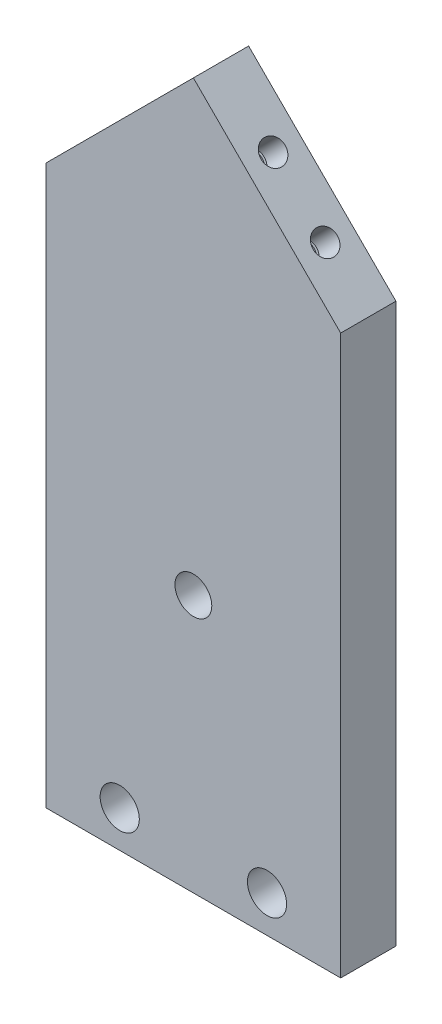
ISO-10303-21;
HEADER;
FILE_DESCRIPTION(('STEP AP214'),'2;1');
FILE_NAME('part.step','',(''),(''),'','','');
FILE_SCHEMA(('AUTOMOTIVE_DESIGN { 1 0 10303 214 1 1 1 1 }'));
ENDSEC;
DATA;
#1=APPLICATION_CONTEXT('core data for automotive mechanical design processes');
#2=APPLICATION_PROTOCOL_DEFINITION('international standard','automotive_design',2000,#1);
#3=PRODUCT_CONTEXT('',#1,'mechanical');
#4=PRODUCT('Part','Part','',(#3));
#5=PRODUCT_RELATED_PRODUCT_CATEGORY('part','',(#4));
#6=PRODUCT_DEFINITION_FORMATION('','',#4);
#7=PRODUCT_DEFINITION_CONTEXT('part definition',#1,'design');
#8=PRODUCT_DEFINITION('design','',#6,#7);
#9=PRODUCT_DEFINITION_SHAPE('','',#8);
#10=(LENGTH_UNIT() NAMED_UNIT(*) SI_UNIT(.MILLI.,.METRE.));
#11=(NAMED_UNIT(*) PLANE_ANGLE_UNIT() SI_UNIT($,.RADIAN.));
#12=(NAMED_UNIT(*) SI_UNIT($,.STERADIAN.) SOLID_ANGLE_UNIT());
#13=UNCERTAINTY_MEASURE_WITH_UNIT(LENGTH_MEASURE(1.E-05),#10,'distance_accuracy_value','');
#14=(GEOMETRIC_REPRESENTATION_CONTEXT(3) GLOBAL_UNCERTAINTY_ASSIGNED_CONTEXT((#13)) GLOBAL_UNIT_ASSIGNED_CONTEXT((#10,
#11,#12)) REPRESENTATION_CONTEXT('',''));
#15=CARTESIAN_POINT('',(0.,0.,0.));
#16=DIRECTION('',(0.,0.,1.));
#17=DIRECTION('',(1.,0.,0.));
#18=AXIS2_PLACEMENT_3D('',#15,#16,#17);
#19=CARTESIAN_POINT('',(5.80526836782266E-13,95.7169118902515,9.525));
#20=DIRECTION('',(1.,0.,0.));
#21=DIRECTION('',(0.,1.,0.));
#22=AXIS2_PLACEMENT_3D('',#19,#20,#21);
#23=PLANE('',#22);
#24=DIRECTION('',(0.,-1.,0.));
#25=VECTOR('',#24,1.);
#26=CARTESIAN_POINT('',(5.80526836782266E-13,95.7169118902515,0.));
#27=LINE('',#26,#25);
#28=CARTESIAN_POINT('',(5.80526836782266E-13,95.7169118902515,0.));
#29=VERTEX_POINT('',#28);
#30=CARTESIAN_POINT('',(0.,-0.584046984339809,0.));
#31=VERTEX_POINT('',#30);
#32=EDGE_CURVE('E112',#29,#31,#27,.T.);
#33=ORIENTED_EDGE('',*,*,#32,.T.);
#34=DIRECTION('',(0.,0.,-1.));
#35=VECTOR('',#34,1.);
#36=CARTESIAN_POINT('',(0.,-0.584046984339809,9.525));
#37=LINE('',#36,#35);
#38=CARTESIAN_POINT('',(0.,-0.584046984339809,9.525));
#39=VERTEX_POINT('',#38);
#40=EDGE_CURVE('E11',#39,#31,#37,.T.);
#41=ORIENTED_EDGE('',*,*,#40,.F.);
#42=DIRECTION('',(0.,-1.,0.));
#43=VECTOR('',#42,1.);
#44=CARTESIAN_POINT('',(5.80526836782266E-13,95.7169118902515,9.525));
#45=LINE('',#44,#43);
#46=CARTESIAN_POINT('',(5.80526836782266E-13,95.7169118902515,9.525));
#47=VERTEX_POINT('',#46);
#48=EDGE_CURVE('E121',#47,#39,#45,.T.);
#49=ORIENTED_EDGE('',*,*,#48,.F.);
#50=DIRECTION('',(0.,0.,-1.));
#51=VECTOR('',#50,1.);
#52=CARTESIAN_POINT('',(5.80526836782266E-13,95.7169118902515,9.525));
#53=LINE('',#52,#51);
#54=EDGE_CURVE('E108',#47,#29,#53,.T.);
#55=ORIENTED_EDGE('',*,*,#54,.T.);
#56=EDGE_LOOP('',(#33,#41,#49,#55));
#57=FACE_BOUND('',#56,.T.);
#58=ADVANCED_FACE('F35',(#57),#23,.F.);
#59=CARTESIAN_POINT('',(0.,-0.584046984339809,9.525));
#60=DIRECTION('',(0.,1.,0.));
#61=DIRECTION('',(-1.,0.,0.));
#62=AXIS2_PLACEMENT_3D('',#59,#60,#61);
#63=PLANE('',#62);
#64=DIRECTION('',(1.,0.,0.));
#65=VECTOR('',#64,1.);
#66=CARTESIAN_POINT('',(0.,-0.584046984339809,0.));
#67=LINE('',#66,#65);
#68=CARTESIAN_POINT('',(50.7999999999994,-0.584046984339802,0.));
#69=VERTEX_POINT('',#68);
#70=EDGE_CURVE('E115',#31,#69,#67,.T.);
#71=ORIENTED_EDGE('',*,*,#70,.T.);
#72=DIRECTION('',(0.,0.,-1.));
#73=VECTOR('',#72,1.);
#74=CARTESIAN_POINT('',(50.7999999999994,-0.584046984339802,9.525));
#75=LINE('',#74,#73);
#76=CARTESIAN_POINT('',(50.7999999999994,-0.584046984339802,9.525));
#77=VERTEX_POINT('',#76);
#78=EDGE_CURVE('E43',#77,#69,#75,.T.);
#79=ORIENTED_EDGE('',*,*,#78,.F.);
#80=DIRECTION('',(1.,0.,0.));
#81=VECTOR('',#80,1.);
#82=CARTESIAN_POINT('',(0.,-0.584046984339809,9.525));
#83=LINE('',#82,#81);
#84=EDGE_CURVE('E86',#39,#77,#83,.T.);
#85=ORIENTED_EDGE('',*,*,#84,.F.);
#86=ORIENTED_EDGE('',*,*,#40,.T.);
#87=EDGE_LOOP('',(#71,#79,#85,#86));
#88=FACE_BOUND('',#87,.T.);
#89=ADVANCED_FACE('F146',(#88),#63,.F.);
#90=CARTESIAN_POINT('',(50.7999999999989,95.7169118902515,9.525));
#91=DIRECTION('',(-1.,0.,0.));
#92=DIRECTION('',(0.,-1.,0.));
#93=AXIS2_PLACEMENT_3D('',#90,#91,#92);
#94=PLANE('',#93);
#95=DIRECTION('',(0.,1.,0.));
#96=VECTOR('',#95,1.);
#97=CARTESIAN_POINT('',(50.7999999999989,95.7169118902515,0.));
#98=LINE('',#97,#96);
#99=CARTESIAN_POINT('',(50.7999999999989,95.7169118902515,0.));
#100=VERTEX_POINT('',#99);
#101=EDGE_CURVE('E103',#69,#100,#98,.T.);
#102=ORIENTED_EDGE('',*,*,#101,.T.);
#103=DIRECTION('',(0.,0.,-1.));
#104=VECTOR('',#103,1.);
#105=CARTESIAN_POINT('',(50.7999999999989,95.7169118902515,9.525));
#106=LINE('',#105,#104);
#107=CARTESIAN_POINT('',(50.7999999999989,95.7169118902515,9.525));
#108=VERTEX_POINT('',#107);
#109=EDGE_CURVE('E100',#108,#100,#106,.T.);
#110=ORIENTED_EDGE('',*,*,#109,.F.);
#111=DIRECTION('',(0.,1.,0.));
#112=VECTOR('',#111,1.);
#113=CARTESIAN_POINT('',(50.7999999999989,95.7169118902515,9.525));
#114=LINE('',#113,#112);
#115=EDGE_CURVE('E92',#77,#108,#114,.T.);
#116=ORIENTED_EDGE('',*,*,#115,.F.);
#117=ORIENTED_EDGE('',*,*,#78,.T.);
#118=EDGE_LOOP('',(#102,#110,#116,#117));
#119=FACE_BOUND('',#118,.T.);
#120=ADVANCED_FACE('F101',(#119),#94,.F.);
#121=CARTESIAN_POINT('',(25.3999999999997,121.116911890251,9.525));
#122=DIRECTION('',(-0.707106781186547,-0.707106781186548,0.));
#123=DIRECTION('',(0.707106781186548,-0.707106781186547,0.));
#124=AXIS2_PLACEMENT_3D('',#121,#122,#123);
#125=PLANE('',#124);
#126=CARTESIAN_POINT('',(34.3802561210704,112.136655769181,4.7625));
#127=DIRECTION('',(0.707106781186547,0.707106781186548,0.));
#128=DIRECTION('',(-0.707106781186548,0.707106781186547,0.));
#129=AXIS2_PLACEMENT_3D('',#126,#127,#128);
#130=CIRCLE('',#129,2.0828);
#131=CARTESIAN_POINT('',(32.9074941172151,113.609417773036,4.7625));
#132=VERTEX_POINT('',#131);
#133=EDGE_CURVE('E374',#132,#132,#130,.T.);
#134=ORIENTED_EDGE('',*,*,#133,.F.);
#135=EDGE_LOOP('',(#134));
#136=FACE_BOUND('',#135,.T.);
#137=CARTESIAN_POINT('',(43.3605122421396,103.156399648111,4.7625));
#138=DIRECTION('',(0.707106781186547,0.707106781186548,0.));
#139=DIRECTION('',(-0.707106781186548,0.707106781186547,0.));
#140=AXIS2_PLACEMENT_3D('',#137,#138,#139);
#141=CIRCLE('',#140,2.0828);
#142=CARTESIAN_POINT('',(41.8877502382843,104.629161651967,4.7625));
#143=VERTEX_POINT('',#142);
#144=EDGE_CURVE('E362',#143,#143,#141,.T.);
#145=ORIENTED_EDGE('',*,*,#144,.F.);
#146=EDGE_LOOP('',(#145));
#147=FACE_BOUND('',#146,.T.);
#148=DIRECTION('',(-0.707106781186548,0.707106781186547,0.));
#149=VECTOR('',#148,1.);
#150=CARTESIAN_POINT('',(25.3999999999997,121.116911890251,0.));
#151=LINE('',#150,#149);
#152=CARTESIAN_POINT('',(25.3999999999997,121.116911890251,0.));
#153=VERTEX_POINT('',#152);
#154=EDGE_CURVE('E72',#100,#153,#151,.T.);
#155=ORIENTED_EDGE('',*,*,#154,.T.);
#156=DIRECTION('',(0.,0.,-1.));
#157=VECTOR('',#156,1.);
#158=CARTESIAN_POINT('',(25.3999999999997,121.116911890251,9.525));
#159=LINE('',#158,#157);
#160=CARTESIAN_POINT('',(25.3999999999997,121.116911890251,9.525));
#161=VERTEX_POINT('',#160);
#162=EDGE_CURVE('E104',#161,#153,#159,.T.);
#163=ORIENTED_EDGE('',*,*,#162,.F.);
#164=DIRECTION('',(-0.707106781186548,0.707106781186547,0.));
#165=VECTOR('',#164,1.);
#166=CARTESIAN_POINT('',(25.3999999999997,121.116911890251,9.525));
#167=LINE('',#166,#165);
#168=EDGE_CURVE('E96',#108,#161,#167,.T.);
#169=ORIENTED_EDGE('',*,*,#168,.F.);
#170=ORIENTED_EDGE('',*,*,#109,.T.);
#171=EDGE_LOOP('',(#155,#163,#169,#170));
#172=FACE_BOUND('',#171,.T.);
#173=ADVANCED_FACE('F106',(#136,#147,#172),#125,.F.);
#174=CARTESIAN_POINT('',(25.3999999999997,121.116911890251,9.525));
#175=DIRECTION('',(0.707106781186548,-0.707106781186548,0.));
#176=DIRECTION('',(0.707106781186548,0.707106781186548,0.));
#177=AXIS2_PLACEMENT_3D('',#174,#175,#176);
#178=PLANE('',#177);
#179=CARTESIAN_POINT('',(16.4197438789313,112.136655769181,4.7625));
#180=DIRECTION('',(-0.707106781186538,0.707106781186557,0.));
#181=DIRECTION('',(-0.707106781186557,-0.707106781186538,0.));
#182=AXIS2_PLACEMENT_3D('',#179,#180,#181);
#183=CIRCLE('',#182,2.0828);
#184=CARTESIAN_POINT('',(14.946981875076,110.663893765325,4.7625));
#185=VERTEX_POINT('',#184);
#186=EDGE_CURVE('E350',#185,#185,#183,.T.);
#187=ORIENTED_EDGE('',*,*,#186,.F.);
#188=EDGE_LOOP('',(#187));
#189=FACE_BOUND('',#188,.T.);
#190=CARTESIAN_POINT('',(7.43948775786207,103.156399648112,4.7625));
#191=DIRECTION('',(-0.707106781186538,0.707106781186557,0.));
#192=DIRECTION('',(-0.707106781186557,-0.707106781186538,0.));
#193=AXIS2_PLACEMENT_3D('',#190,#191,#192);
#194=CIRCLE('',#193,2.0828);
#195=CARTESIAN_POINT('',(5.96672575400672,101.683637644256,4.7625));
#196=VERTEX_POINT('',#195);
#197=EDGE_CURVE('E338',#196,#196,#194,.T.);
#198=ORIENTED_EDGE('',*,*,#197,.F.);
#199=EDGE_LOOP('',(#198));
#200=FACE_BOUND('',#199,.T.);
#201=DIRECTION('',(-0.707106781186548,-0.707106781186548,0.));
#202=VECTOR('',#201,1.);
#203=CARTESIAN_POINT('',(25.3999999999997,121.116911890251,0.));
#204=LINE('',#203,#202);
#205=EDGE_CURVE('E78',#153,#29,#204,.T.);
#206=ORIENTED_EDGE('',*,*,#205,.T.);
#207=ORIENTED_EDGE('',*,*,#54,.F.);
#208=DIRECTION('',(-0.707106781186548,-0.707106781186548,0.));
#209=VECTOR('',#208,1.);
#210=CARTESIAN_POINT('',(25.3999999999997,121.116911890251,9.525));
#211=LINE('',#210,#209);
#212=EDGE_CURVE('E51',#161,#47,#211,.T.);
#213=ORIENTED_EDGE('',*,*,#212,.F.);
#214=ORIENTED_EDGE('',*,*,#162,.T.);
#215=EDGE_LOOP('',(#206,#207,#213,#214));
#216=FACE_BOUND('',#215,.T.);
#217=ADVANCED_FACE('F129',(#189,#200,#216),#178,.F.);
#218=CARTESIAN_POINT('',(0.,0.,9.525));
#219=DIRECTION('',(0.,0.,1.));
#220=DIRECTION('',(1.,0.,0.));
#221=AXIS2_PLACEMENT_3D('',#218,#219,#220);
#222=PLANE('',#221);
#223=CARTESIAN_POINT('',(25.3999999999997,43.8659530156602,9.525));
#224=DIRECTION('',(0.,0.,1.));
#225=DIRECTION('',(1.,0.,0.));
#226=AXIS2_PLACEMENT_3D('',#223,#224,#225);
#227=CIRCLE('',#226,3.175);
#228=CARTESIAN_POINT('',(28.5749999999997,43.8659530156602,9.525));
#229=VERTEX_POINT('',#228);
#230=EDGE_CURVE('E380',#229,#229,#227,.T.);
#231=ORIENTED_EDGE('',*,*,#230,.F.);
#232=EDGE_LOOP('',(#231));
#233=FACE_BOUND('',#232,.T.);
#234=CARTESIAN_POINT('',(12.6999999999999,5.76595301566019,9.525));
#235=DIRECTION('',(0.,0.,1.));
#236=DIRECTION('',(1.,0.,0.));
#237=AXIS2_PLACEMENT_3D('',#234,#235,#236);
#238=CIRCLE('',#237,3.37819999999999);
#239=CARTESIAN_POINT('',(16.0781999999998,5.76595301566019,9.525));
#240=VERTEX_POINT('',#239);
#241=EDGE_CURVE('E323',#240,#240,#238,.T.);
#242=ORIENTED_EDGE('',*,*,#241,.F.);
#243=EDGE_LOOP('',(#242));
#244=FACE_BOUND('',#243,.T.);
#245=CARTESIAN_POINT('',(38.0999999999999,5.76595301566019,9.525));
#246=DIRECTION('',(0.,0.,1.));
#247=DIRECTION('',(1.,0.,0.));
#248=AXIS2_PLACEMENT_3D('',#245,#246,#247);
#249=CIRCLE('',#248,3.37819999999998);
#250=CARTESIAN_POINT('',(41.4781999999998,5.76595301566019,9.525));
#251=VERTEX_POINT('',#250);
#252=EDGE_CURVE('E317',#251,#251,#249,.T.);
#253=ORIENTED_EDGE('',*,*,#252,.F.);
#254=EDGE_LOOP('',(#253));
#255=FACE_BOUND('',#254,.T.);
#256=ORIENTED_EDGE('',*,*,#48,.T.);
#257=ORIENTED_EDGE('',*,*,#84,.T.);
#258=ORIENTED_EDGE('',*,*,#115,.T.);
#259=ORIENTED_EDGE('',*,*,#168,.T.);
#260=ORIENTED_EDGE('',*,*,#212,.T.);
#261=EDGE_LOOP('',(#256,#257,#258,#259,#260));
#262=FACE_BOUND('',#261,.T.);
#263=ADVANCED_FACE('F94',(#233,#244,#255,#262),#222,.T.);
#264=CARTESIAN_POINT('',(0.,0.,0.));
#265=DIRECTION('',(0.,0.,1.));
#266=DIRECTION('',(1.,0.,0.));
#267=AXIS2_PLACEMENT_3D('',#264,#265,#266);
#268=PLANE('',#267);
#269=CARTESIAN_POINT('',(25.3999999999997,43.8659530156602,0.));
#270=DIRECTION('',(0.,0.,1.));
#271=DIRECTION('',(1.,0.,0.));
#272=AXIS2_PLACEMENT_3D('',#269,#270,#271);
#273=CIRCLE('',#272,3.175);
#274=CARTESIAN_POINT('',(28.5749999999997,43.8659530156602,0.));
#275=VERTEX_POINT('',#274);
#276=EDGE_CURVE('E377',#275,#275,#273,.T.);
#277=ORIENTED_EDGE('',*,*,#276,.T.);
#278=EDGE_LOOP('',(#277));
#279=FACE_BOUND('',#278,.T.);
#280=CARTESIAN_POINT('',(12.6999999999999,5.76595301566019,0.));
#281=DIRECTION('',(0.,0.,1.));
#282=DIRECTION('',(1.,0.,0.));
#283=AXIS2_PLACEMENT_3D('',#280,#281,#282);
#284=CIRCLE('',#283,3.3782);
#285=CARTESIAN_POINT('',(16.0781999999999,5.76595301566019,0.));
#286=VERTEX_POINT('',#285);
#287=EDGE_CURVE('E319',#286,#286,#284,.T.);
#288=ORIENTED_EDGE('',*,*,#287,.T.);
#289=EDGE_LOOP('',(#288));
#290=FACE_BOUND('',#289,.T.);
#291=CARTESIAN_POINT('',(38.0999999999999,5.76595301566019,0.));
#292=DIRECTION('',(0.,0.,1.));
#293=DIRECTION('',(1.,0.,0.));
#294=AXIS2_PLACEMENT_3D('',#291,#292,#293);
#295=CIRCLE('',#294,3.3782);
#296=CARTESIAN_POINT('',(41.4781999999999,5.76595301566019,0.));
#297=VERTEX_POINT('',#296);
#298=EDGE_CURVE('E116',#297,#297,#295,.T.);
#299=ORIENTED_EDGE('',*,*,#298,.T.);
#300=EDGE_LOOP('',(#299));
#301=FACE_BOUND('',#300,.T.);
#302=ORIENTED_EDGE('',*,*,#32,.F.);
#303=ORIENTED_EDGE('',*,*,#205,.F.);
#304=ORIENTED_EDGE('',*,*,#154,.F.);
#305=ORIENTED_EDGE('',*,*,#101,.F.);
#306=ORIENTED_EDGE('',*,*,#70,.F.);
#307=EDGE_LOOP('',(#302,#303,#304,#305,#306));
#308=FACE_BOUND('',#307,.T.);
#309=ADVANCED_FACE('F125',(#279,#290,#301,#308),#268,.F.);
#310=CARTESIAN_POINT('',(38.0999999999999,5.76595301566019,9.525));
#311=DIRECTION('',(0.,0.,1.));
#312=DIRECTION('',(1.,0.,0.));
#313=AXIS2_PLACEMENT_3D('',#310,#311,#312);
#314=CYLINDRICAL_SURFACE('',#313,3.37819999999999);
#315=ORIENTED_EDGE('',*,*,#298,.F.);
#316=EDGE_LOOP('',(#315));
#317=FACE_BOUND('',#316,.T.);
#318=ORIENTED_EDGE('',*,*,#252,.T.);
#319=EDGE_LOOP('',(#318));
#320=FACE_BOUND('',#319,.T.);
#321=ADVANCED_FACE('F262',(#317,#320),#314,.F.);
#322=CARTESIAN_POINT('',(12.6999999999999,5.76595301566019,9.525));
#323=DIRECTION('',(0.,0.,1.));
#324=DIRECTION('',(1.,0.,0.));
#325=AXIS2_PLACEMENT_3D('',#322,#323,#324);
#326=CYLINDRICAL_SURFACE('',#325,3.37819999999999);
#327=ORIENTED_EDGE('',*,*,#287,.F.);
#328=EDGE_LOOP('',(#327));
#329=FACE_BOUND('',#328,.T.);
#330=ORIENTED_EDGE('',*,*,#241,.T.);
#331=EDGE_LOOP('',(#330));
#332=FACE_BOUND('',#331,.T.);
#333=ADVANCED_FACE('F305',(#329,#332),#326,.F.);
#334=CARTESIAN_POINT('',(12.6480363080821,97.9478510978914,4.7625));
#335=DIRECTION('',(-0.707106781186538,0.707106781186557,0.));
#336=DIRECTION('',(-0.707106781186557,-0.707106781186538,0.));
#337=AXIS2_PLACEMENT_3D('',#334,#335,#336);
#338=CONICAL_SURFACE('',#337,1.7272,1.02974425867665);
#339=CARTESIAN_POINT('',(13.3818762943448,97.2140111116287,4.7625));
#340=VERTEX_POINT('',#339);
#341=VERTEX_LOOP('',#340);
#342=FACE_BOUND('',#341,.T.);
#343=CARTESIAN_POINT('',(12.6480363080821,97.9478510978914,4.7625));
#344=DIRECTION('',(-0.707106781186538,0.707106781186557,0.));
#345=DIRECTION('',(-0.707106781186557,-0.707106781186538,0.));
#346=AXIS2_PLACEMENT_3D('',#343,#344,#345);
#347=CIRCLE('',#346,1.7272);
#348=CARTESIAN_POINT('',(11.4267214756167,96.726536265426,4.7625));
#349=VERTEX_POINT('',#348);
#350=EDGE_CURVE('E329',#349,#349,#347,.T.);
#351=ORIENTED_EDGE('',*,*,#350,.T.);
#352=EDGE_LOOP('',(#351));
#353=FACE_BOUND('',#352,.T.);
#354=ADVANCED_FACE('F301',(#342,#353),#338,.F.);
#355=CARTESIAN_POINT('',(7.43948775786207,103.156399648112,4.7625));
#356=DIRECTION('',(-0.707106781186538,0.707106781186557,0.));
#357=DIRECTION('',(-0.707106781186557,-0.707106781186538,0.));
#358=AXIS2_PLACEMENT_3D('',#355,#356,#357);
#359=CYLINDRICAL_SURFACE('',#358,1.7272);
#360=ORIENTED_EDGE('',*,*,#350,.F.);
#361=EDGE_LOOP('',(#360));
#362=FACE_BOUND('',#361,.T.);
#363=CARTESIAN_POINT('',(11.0315902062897,99.5642971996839,4.7625));
#364=DIRECTION('',(-0.707106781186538,0.707106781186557,0.));
#365=DIRECTION('',(-0.707106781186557,-0.707106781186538,0.));
#366=AXIS2_PLACEMENT_3D('',#363,#364,#365);
#367=CIRCLE('',#366,1.7272);
#368=CARTESIAN_POINT('',(9.81027537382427,98.3429823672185,4.7625));
#369=VERTEX_POINT('',#368);
#370=EDGE_CURVE('E332',#369,#369,#367,.T.);
#371=ORIENTED_EDGE('',*,*,#370,.T.);
#372=EDGE_LOOP('',(#371));
#373=FACE_BOUND('',#372,.T.);
#374=ADVANCED_FACE('F297',(#362,#373),#359,.F.);
#375=CARTESIAN_POINT('',(11.0315902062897,99.5642971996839,6.4897));
#376=DIRECTION('',(0.707106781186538,-0.707106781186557,0.));
#377=DIRECTION('',(0.707106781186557,0.707106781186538,0.));
#378=AXIS2_PLACEMENT_3D('',#375,#376,#377);
#379=PLANE('',#378);
#380=ORIENTED_EDGE('',*,*,#370,.F.);
#381=EDGE_LOOP('',(#380));
#382=FACE_BOUND('',#381,.T.);
#383=CARTESIAN_POINT('',(11.0315902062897,99.5642971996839,4.7625));
#384=DIRECTION('',(-0.707106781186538,0.707106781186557,0.));
#385=DIRECTION('',(-0.707106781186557,-0.707106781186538,0.));
#386=AXIS2_PLACEMENT_3D('',#383,#384,#385);
#387=CIRCLE('',#386,2.0828);
#388=CARTESIAN_POINT('',(9.55882820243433,98.0915351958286,4.7625));
#389=VERTEX_POINT('',#388);
#390=EDGE_CURVE('E335',#389,#389,#387,.T.);
#391=ORIENTED_EDGE('',*,*,#390,.T.);
#392=EDGE_LOOP('',(#391));
#393=FACE_BOUND('',#392,.T.);
#394=ADVANCED_FACE('F293',(#382,#393),#379,.F.);
#395=CARTESIAN_POINT('',(7.43948775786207,103.156399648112,4.7625));
#396=DIRECTION('',(-0.707106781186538,0.707106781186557,0.));
#397=DIRECTION('',(-0.707106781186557,-0.707106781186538,0.));
#398=AXIS2_PLACEMENT_3D('',#395,#396,#397);
#399=CYLINDRICAL_SURFACE('',#398,2.0828);
#400=ORIENTED_EDGE('',*,*,#390,.F.);
#401=EDGE_LOOP('',(#400));
#402=FACE_BOUND('',#401,.T.);
#403=ORIENTED_EDGE('',*,*,#197,.T.);
#404=EDGE_LOOP('',(#403));
#405=FACE_BOUND('',#404,.T.);
#406=ADVANCED_FACE('F289',(#402,#405),#399,.F.);
#407=CARTESIAN_POINT('',(21.6282924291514,106.92810721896,4.7625));
#408=DIRECTION('',(-0.707106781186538,0.707106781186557,0.));
#409=DIRECTION('',(-0.707106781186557,-0.707106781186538,0.));
#410=AXIS2_PLACEMENT_3D('',#407,#408,#409);
#411=CONICAL_SURFACE('',#410,1.7272,1.02974425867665);
#412=CARTESIAN_POINT('',(22.3621324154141,106.194267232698,4.7625));
#413=VERTEX_POINT('',#412);
#414=VERTEX_LOOP('',#413);
#415=FACE_BOUND('',#414,.T.);
#416=CARTESIAN_POINT('',(21.6282924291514,106.92810721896,4.7625));
#417=DIRECTION('',(-0.707106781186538,0.707106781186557,0.));
#418=DIRECTION('',(-0.707106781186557,-0.707106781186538,0.));
#419=AXIS2_PLACEMENT_3D('',#416,#417,#418);
#420=CIRCLE('',#419,1.7272);
#421=CARTESIAN_POINT('',(20.406977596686,105.706792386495,4.7625));
#422=VERTEX_POINT('',#421);
#423=EDGE_CURVE('E341',#422,#422,#420,.T.);
#424=ORIENTED_EDGE('',*,*,#423,.T.);
#425=EDGE_LOOP('',(#424));
#426=FACE_BOUND('',#425,.T.);
#427=ADVANCED_FACE('F285',(#415,#426),#411,.F.);
#428=CARTESIAN_POINT('',(16.4197438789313,112.136655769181,4.7625));
#429=DIRECTION('',(-0.707106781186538,0.707106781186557,0.));
#430=DIRECTION('',(-0.707106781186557,-0.707106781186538,0.));
#431=AXIS2_PLACEMENT_3D('',#428,#429,#430);
#432=CYLINDRICAL_SURFACE('',#431,1.7272);
#433=ORIENTED_EDGE('',*,*,#423,.F.);
#434=EDGE_LOOP('',(#433));
#435=FACE_BOUND('',#434,.T.);
#436=CARTESIAN_POINT('',(20.011846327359,108.544553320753,4.7625));
#437=DIRECTION('',(-0.707106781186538,0.707106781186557,0.));
#438=DIRECTION('',(-0.707106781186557,-0.707106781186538,0.));
#439=AXIS2_PLACEMENT_3D('',#436,#437,#438);
#440=CIRCLE('',#439,1.7272);
#441=CARTESIAN_POINT('',(18.7905314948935,107.323238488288,4.7625));
#442=VERTEX_POINT('',#441);
#443=EDGE_CURVE('E344',#442,#442,#440,.T.);
#444=ORIENTED_EDGE('',*,*,#443,.T.);
#445=EDGE_LOOP('',(#444));
#446=FACE_BOUND('',#445,.T.);
#447=ADVANCED_FACE('F281',(#435,#446),#432,.F.);
#448=CARTESIAN_POINT('',(20.011846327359,108.544553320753,6.4897));
#449=DIRECTION('',(0.707106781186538,-0.707106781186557,0.));
#450=DIRECTION('',(0.707106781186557,0.707106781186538,0.));
#451=AXIS2_PLACEMENT_3D('',#448,#449,#450);
#452=PLANE('',#451);
#453=ORIENTED_EDGE('',*,*,#443,.F.);
#454=EDGE_LOOP('',(#453));
#455=FACE_BOUND('',#454,.T.);
#456=CARTESIAN_POINT('',(20.011846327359,108.544553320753,4.7625));
#457=DIRECTION('',(-0.707106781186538,0.707106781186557,0.));
#458=DIRECTION('',(-0.707106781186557,-0.707106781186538,0.));
#459=AXIS2_PLACEMENT_3D('',#456,#457,#458);
#460=CIRCLE('',#459,2.0828);
#461=CARTESIAN_POINT('',(18.5390843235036,107.071791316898,4.7625));
#462=VERTEX_POINT('',#461);
#463=EDGE_CURVE('E347',#462,#462,#460,.T.);
#464=ORIENTED_EDGE('',*,*,#463,.T.);
#465=EDGE_LOOP('',(#464));
#466=FACE_BOUND('',#465,.T.);
#467=ADVANCED_FACE('F277',(#455,#466),#452,.F.);
#468=CARTESIAN_POINT('',(16.4197438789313,112.136655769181,4.7625));
#469=DIRECTION('',(-0.707106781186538,0.707106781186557,0.));
#470=DIRECTION('',(-0.707106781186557,-0.707106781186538,0.));
#471=AXIS2_PLACEMENT_3D('',#468,#469,#470);
#472=CYLINDRICAL_SURFACE('',#471,2.0828);
#473=ORIENTED_EDGE('',*,*,#463,.F.);
#474=EDGE_LOOP('',(#473));
#475=FACE_BOUND('',#474,.T.);
#476=ORIENTED_EDGE('',*,*,#186,.T.);
#477=EDGE_LOOP('',(#476));
#478=FACE_BOUND('',#477,.T.);
#479=ADVANCED_FACE('F168',(#475,#478),#472,.F.);
#480=CARTESIAN_POINT('',(38.1519636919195,97.9478510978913,4.7625));
#481=DIRECTION('',(0.707106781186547,0.707106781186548,0.));
#482=DIRECTION('',(-0.707106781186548,0.707106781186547,0.));
#483=AXIS2_PLACEMENT_3D('',#480,#481,#482);
#484=CONICAL_SURFACE('',#483,1.7272,1.02974425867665);
#485=CARTESIAN_POINT('',(37.4181237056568,97.2140111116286,4.7625));
#486=VERTEX_POINT('',#485);
#487=VERTEX_LOOP('',#486);
#488=FACE_BOUND('',#487,.T.);
#489=CARTESIAN_POINT('',(38.1519636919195,97.9478510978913,4.7625));
#490=DIRECTION('',(0.707106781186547,0.707106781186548,0.));
#491=DIRECTION('',(-0.707106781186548,0.707106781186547,0.));
#492=AXIS2_PLACEMENT_3D('',#489,#490,#491);
#493=CIRCLE('',#492,1.7272);
#494=CARTESIAN_POINT('',(36.9306488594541,99.1691659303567,4.7625));
#495=VERTEX_POINT('',#494);
#496=EDGE_CURVE('E353',#495,#495,#493,.T.);
#497=ORIENTED_EDGE('',*,*,#496,.T.);
#498=EDGE_LOOP('',(#497));
#499=FACE_BOUND('',#498,.T.);
#500=ADVANCED_FACE('F173',(#488,#499),#484,.F.);
#501=CARTESIAN_POINT('',(43.3605122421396,103.156399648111,4.7625));
#502=DIRECTION('',(0.707106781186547,0.707106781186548,0.));
#503=DIRECTION('',(-0.707106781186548,0.707106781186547,0.));
#504=AXIS2_PLACEMENT_3D('',#501,#502,#503);
#505=CYLINDRICAL_SURFACE('',#504,1.7272);
#506=ORIENTED_EDGE('',*,*,#496,.F.);
#507=EDGE_LOOP('',(#506));
#508=FACE_BOUND('',#507,.T.);
#509=CARTESIAN_POINT('',(39.7684097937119,99.5642971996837,4.7625));
#510=DIRECTION('',(0.707106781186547,0.707106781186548,0.));
#511=DIRECTION('',(-0.707106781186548,0.707106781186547,0.));
#512=AXIS2_PLACEMENT_3D('',#509,#510,#511);
#513=CIRCLE('',#512,1.7272);
#514=CARTESIAN_POINT('',(38.5470949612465,100.785612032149,4.7625));
#515=VERTEX_POINT('',#514);
#516=EDGE_CURVE('E356',#515,#515,#513,.T.);
#517=ORIENTED_EDGE('',*,*,#516,.T.);
#518=EDGE_LOOP('',(#517));
#519=FACE_BOUND('',#518,.T.);
#520=ADVANCED_FACE('F178',(#508,#519),#505,.F.);
#521=CARTESIAN_POINT('',(39.768409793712,99.5642971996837,6.4897));
#522=DIRECTION('',(-0.707106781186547,-0.707106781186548,0.));
#523=DIRECTION('',(0.707106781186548,-0.707106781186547,0.));
#524=AXIS2_PLACEMENT_3D('',#521,#522,#523);
#525=PLANE('',#524);
#526=ORIENTED_EDGE('',*,*,#516,.F.);
#527=EDGE_LOOP('',(#526));
#528=FACE_BOUND('',#527,.T.);
#529=CARTESIAN_POINT('',(39.7684097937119,99.5642971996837,4.7625));
#530=DIRECTION('',(0.707106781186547,0.707106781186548,0.));
#531=DIRECTION('',(-0.707106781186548,0.707106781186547,0.));
#532=AXIS2_PLACEMENT_3D('',#529,#530,#531);
#533=CIRCLE('',#532,2.0828);
#534=CARTESIAN_POINT('',(38.2956477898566,101.037059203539,4.7625));
#535=VERTEX_POINT('',#534);
#536=EDGE_CURVE('E359',#535,#535,#533,.T.);
#537=ORIENTED_EDGE('',*,*,#536,.T.);
#538=EDGE_LOOP('',(#537));
#539=FACE_BOUND('',#538,.T.);
#540=ADVANCED_FACE('F188',(#528,#539),#525,.F.);
#541=CARTESIAN_POINT('',(43.3605122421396,103.156399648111,4.7625));
#542=DIRECTION('',(0.707106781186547,0.707106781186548,0.));
#543=DIRECTION('',(-0.707106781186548,0.707106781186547,0.));
#544=AXIS2_PLACEMENT_3D('',#541,#542,#543);
#545=CYLINDRICAL_SURFACE('',#544,2.0828);
#546=ORIENTED_EDGE('',*,*,#536,.F.);
#547=EDGE_LOOP('',(#546));
#548=FACE_BOUND('',#547,.T.);
#549=ORIENTED_EDGE('',*,*,#144,.T.);
#550=EDGE_LOOP('',(#549));
#551=FACE_BOUND('',#550,.T.);
#552=ADVANCED_FACE('F198',(#548,#551),#545,.F.);
#553=CARTESIAN_POINT('',(29.1717075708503,106.92810721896,4.7625));
#554=DIRECTION('',(0.707106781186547,0.707106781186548,0.));
#555=DIRECTION('',(-0.707106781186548,0.707106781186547,0.));
#556=AXIS2_PLACEMENT_3D('',#553,#554,#555);
#557=CONICAL_SURFACE('',#556,1.7272,1.02974425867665);
#558=CARTESIAN_POINT('',(28.4378675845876,106.194267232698,4.7625));
#559=VERTEX_POINT('',#558);
#560=VERTEX_LOOP('',#559);
#561=FACE_BOUND('',#560,.T.);
#562=CARTESIAN_POINT('',(29.1717075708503,106.92810721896,4.7625));
#563=DIRECTION('',(0.707106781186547,0.707106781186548,0.));
#564=DIRECTION('',(-0.707106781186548,0.707106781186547,0.));
#565=AXIS2_PLACEMENT_3D('',#562,#563,#564);
#566=CIRCLE('',#565,1.7272);
#567=CARTESIAN_POINT('',(27.9503927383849,108.149422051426,4.7625));
#568=VERTEX_POINT('',#567);
#569=EDGE_CURVE('E365',#568,#568,#566,.T.);
#570=ORIENTED_EDGE('',*,*,#569,.T.);
#571=EDGE_LOOP('',(#570));
#572=FACE_BOUND('',#571,.T.);
#573=ADVANCED_FACE('F208',(#561,#572),#557,.F.);
#574=CARTESIAN_POINT('',(34.3802561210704,112.136655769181,4.7625));
#575=DIRECTION('',(0.707106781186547,0.707106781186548,0.));
#576=DIRECTION('',(-0.707106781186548,0.707106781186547,0.));
#577=AXIS2_PLACEMENT_3D('',#574,#575,#576);
#578=CYLINDRICAL_SURFACE('',#577,1.7272);
#579=ORIENTED_EDGE('',*,*,#569,.F.);
#580=EDGE_LOOP('',(#579));
#581=FACE_BOUND('',#580,.T.);
#582=CARTESIAN_POINT('',(30.7881536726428,108.544553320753,4.7625));
#583=DIRECTION('',(0.707106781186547,0.707106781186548,0.));
#584=DIRECTION('',(-0.707106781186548,0.707106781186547,0.));
#585=AXIS2_PLACEMENT_3D('',#582,#583,#584);
#586=CIRCLE('',#585,1.7272);
#587=CARTESIAN_POINT('',(29.5668388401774,109.765868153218,4.7625));
#588=VERTEX_POINT('',#587);
#589=EDGE_CURVE('E368',#588,#588,#586,.T.);
#590=ORIENTED_EDGE('',*,*,#589,.T.);
#591=EDGE_LOOP('',(#590));
#592=FACE_BOUND('',#591,.T.);
#593=ADVANCED_FACE('F218',(#581,#592),#578,.F.);
#594=CARTESIAN_POINT('',(30.7881536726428,108.544553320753,6.4897));
#595=DIRECTION('',(-0.707106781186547,-0.707106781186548,0.));
#596=DIRECTION('',(0.707106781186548,-0.707106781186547,0.));
#597=AXIS2_PLACEMENT_3D('',#594,#595,#596);
#598=PLANE('',#597);
#599=ORIENTED_EDGE('',*,*,#589,.F.);
#600=EDGE_LOOP('',(#599));
#601=FACE_BOUND('',#600,.T.);
#602=CARTESIAN_POINT('',(30.7881536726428,108.544553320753,4.7625));
#603=DIRECTION('',(0.707106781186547,0.707106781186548,0.));
#604=DIRECTION('',(-0.707106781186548,0.707106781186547,0.));
#605=AXIS2_PLACEMENT_3D('',#602,#603,#604);
#606=CIRCLE('',#605,2.0828);
#607=CARTESIAN_POINT('',(29.3153916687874,110.017315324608,4.7625));
#608=VERTEX_POINT('',#607);
#609=EDGE_CURVE('E371',#608,#608,#606,.T.);
#610=ORIENTED_EDGE('',*,*,#609,.T.);
#611=EDGE_LOOP('',(#610));
#612=FACE_BOUND('',#611,.T.);
#613=ADVANCED_FACE('F228',(#601,#612),#598,.F.);
#614=CARTESIAN_POINT('',(34.3802561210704,112.136655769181,4.7625));
#615=DIRECTION('',(0.707106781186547,0.707106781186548,0.));
#616=DIRECTION('',(-0.707106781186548,0.707106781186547,0.));
#617=AXIS2_PLACEMENT_3D('',#614,#615,#616);
#618=CYLINDRICAL_SURFACE('',#617,2.0828);
#619=ORIENTED_EDGE('',*,*,#609,.F.);
#620=EDGE_LOOP('',(#619));
#621=FACE_BOUND('',#620,.T.);
#622=ORIENTED_EDGE('',*,*,#133,.T.);
#623=EDGE_LOOP('',(#622));
#624=FACE_BOUND('',#623,.T.);
#625=ADVANCED_FACE('F238',(#621,#624),#618,.F.);
#626=CARTESIAN_POINT('',(25.3999999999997,43.8659530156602,9.525));
#627=DIRECTION('',(0.,0.,1.));
#628=DIRECTION('',(1.,0.,0.));
#629=AXIS2_PLACEMENT_3D('',#626,#627,#628);
#630=CYLINDRICAL_SURFACE('',#629,3.175);
#631=ORIENTED_EDGE('',*,*,#276,.F.);
#632=EDGE_LOOP('',(#631));
#633=FACE_BOUND('',#632,.T.);
#634=ORIENTED_EDGE('',*,*,#230,.T.);
#635=EDGE_LOOP('',(#634));
#636=FACE_BOUND('',#635,.T.);
#637=ADVANCED_FACE('F247',(#633,#636),#630,.F.);
#638=CLOSED_SHELL('',(#58,#89,#120,#173,#217,#263,#309,#321,#333,#354,#374,#394,#406,#427,#447,
#467,#479,#500,#520,#540,#552,#573,#593,#613,#625,#637));
#639=MANIFOLD_SOLID_BREP('B2',#638);
#640=ADVANCED_BREP_SHAPE_REPRESENTATION('',(#18,#639),#14);
#641=SHAPE_DEFINITION_REPRESENTATION(#9,#640);
ENDSEC;
END-ISO-10303-21;
